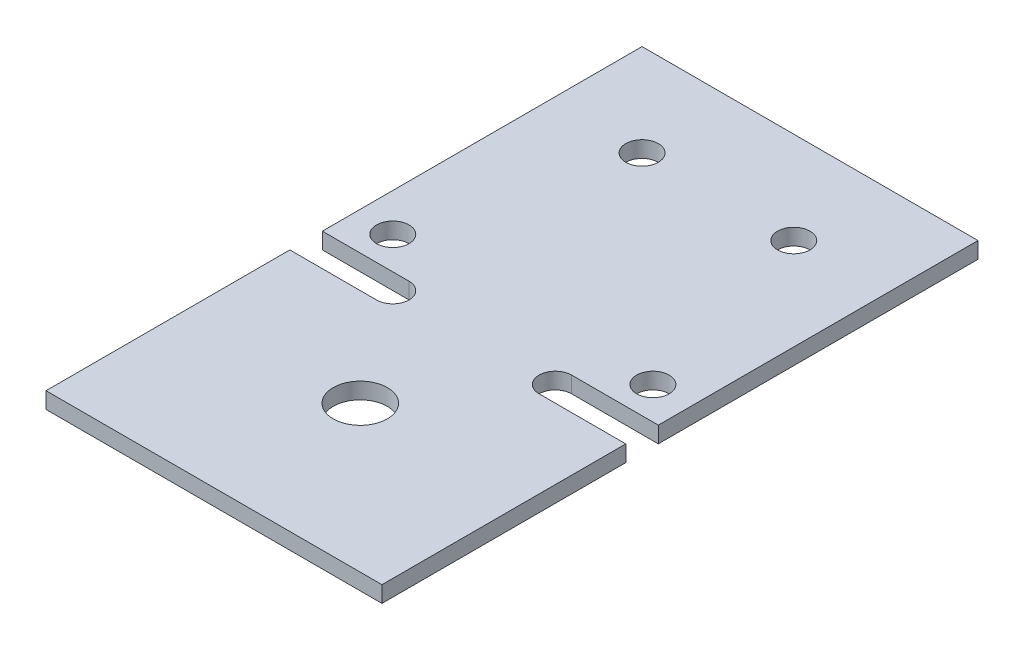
from build123d import *

# Parameters (mm, degrees)
SKETCH1_R      = 5
SKETCH1_R_2    = 3
EXTRUDE1_DEPTH = 3


with BuildPart() as part:
    # Sketch1 → Extrude1 (new body)
    with BuildSketch(Plane(origin=(0, 0, 0), x_dir=(1, 0, 0), z_dir=(0, 1, 0))):
        with BuildLine():
            Line((0, 45), (16, 45))
            ThreePointArc((16, 45), (19, 48), (16, 51))
            Line((16, 51), (0, 51))
            Line((0, 51), (0, 110))
            Line((0, 110), (62, 110))
            Line((62, 110), (62, 51))
            Line((62, 51), (46, 51))
            ThreePointArc((46, 51), (43, 48), (46, 45))
            Line((46, 45), (62, 45))
            Line((62, 45), (62, 0))
            Line((62, 0), (0, 0))
            Line((0, 0), (0, 45))
        make_face()
        with Locations(Location((31, 27, 0), (0, 0, 270))):
            Circle(SKETCH1_R, mode=Mode.SUBTRACT)
        with Locations(Location((17, 93, 0), (0, 0, 270))):
            Circle(SKETCH1_R_2, mode=Mode.SUBTRACT)
        with Locations(Location((45, 93, 0), (0, 0, 270))):
            Circle(SKETCH1_R_2, mode=Mode.SUBTRACT)
        with Locations(Location((7, 57, 0), (0, 0, 270))):
            Circle(SKETCH1_R_2, mode=Mode.SUBTRACT)
        with Locations(Location((55, 57, 0), (0, 0, 270))):
            Circle(SKETCH1_R_2, mode=Mode.SUBTRACT)
    extrude(amount=EXTRUDE1_DEPTH)


solid = part.part
